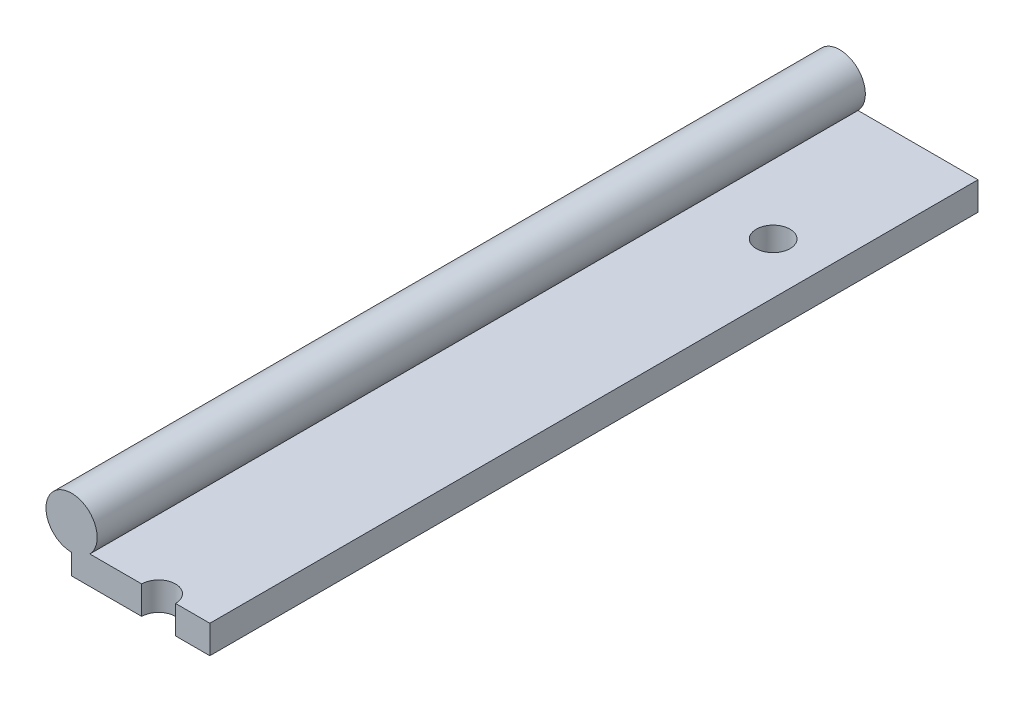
ISO-10303-21;
HEADER;
FILE_DESCRIPTION(('STEP AP214'),'2;1');
FILE_NAME('part.step','',(''),(''),'','','');
FILE_SCHEMA(('AUTOMOTIVE_DESIGN { 1 0 10303 214 1 1 1 1 }'));
ENDSEC;
DATA;
#1=APPLICATION_CONTEXT('core data for automotive mechanical design processes');
#2=APPLICATION_PROTOCOL_DEFINITION('international standard','automotive_design',2000,#1);
#3=PRODUCT_CONTEXT('',#1,'mechanical');
#4=PRODUCT('Part','Part','',(#3));
#5=PRODUCT_RELATED_PRODUCT_CATEGORY('part','',(#4));
#6=PRODUCT_DEFINITION_FORMATION('','',#4);
#7=PRODUCT_DEFINITION_CONTEXT('part definition',#1,'design');
#8=PRODUCT_DEFINITION('design','',#6,#7);
#9=PRODUCT_DEFINITION_SHAPE('','',#8);
#10=(LENGTH_UNIT() NAMED_UNIT(*) SI_UNIT(.MILLI.,.METRE.));
#11=(NAMED_UNIT(*) PLANE_ANGLE_UNIT() SI_UNIT($,.RADIAN.));
#12=(NAMED_UNIT(*) SI_UNIT($,.STERADIAN.) SOLID_ANGLE_UNIT());
#13=UNCERTAINTY_MEASURE_WITH_UNIT(LENGTH_MEASURE(1.E-05),#10,'distance_accuracy_value','');
#14=(GEOMETRIC_REPRESENTATION_CONTEXT(3) GLOBAL_UNCERTAINTY_ASSIGNED_CONTEXT((#13)) GLOBAL_UNIT_ASSIGNED_CONTEXT((#10,
#11,#12)) REPRESENTATION_CONTEXT('',''));
#15=CARTESIAN_POINT('',(0.,0.,0.));
#16=DIRECTION('',(0.,0.,1.));
#17=DIRECTION('',(1.,0.,0.));
#18=AXIS2_PLACEMENT_3D('',#15,#16,#17);
#19=CARTESIAN_POINT('',(-13.5,6.24999999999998,150.));
#20=DIRECTION('',(0.,0.,-1.));
#21=DIRECTION('',(-1.,0.,0.));
#22=AXIS2_PLACEMENT_3D('',#19,#20,#21);
#23=PLANE('',#22);
#24=DIRECTION('',(1.,0.,0.));
#25=VECTOR('',#24,1.);
#26=CARTESIAN_POINT('',(13.5,-2.75000000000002,150.));
#27=LINE('',#26,#25);
#28=CARTESIAN_POINT('',(-13.5,-2.75000000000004,150.));
#29=VERTEX_POINT('',#28);
#30=CARTESIAN_POINT('',(0.200000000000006,-2.75000000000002,150.));
#31=VERTEX_POINT('',#30);
#32=EDGE_CURVE('E121',#29,#31,#27,.T.);
#33=ORIENTED_EDGE('',*,*,#32,.T.);
#34=DIRECTION('',(0.,1.,0.));
#35=VECTOR('',#34,1.);
#36=CARTESIAN_POINT('',(0.199999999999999,2.74999999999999,150.));
#37=LINE('',#36,#35);
#38=CARTESIAN_POINT('',(0.199999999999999,2.74999999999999,150.));
#39=VERTEX_POINT('',#38);
#40=EDGE_CURVE('E11',#31,#39,#37,.T.);
#41=ORIENTED_EDGE('',*,*,#40,.T.);
#42=DIRECTION('',(-1.,0.,0.));
#43=VECTOR('',#42,1.);
#44=CARTESIAN_POINT('',(13.5,2.74999999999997,150.));
#45=LINE('',#44,#43);
#46=CARTESIAN_POINT('',(-9.92928578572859,2.74999999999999,150.));
#47=VERTEX_POINT('',#46);
#48=EDGE_CURVE('E103',#39,#47,#45,.T.);
#49=ORIENTED_EDGE('',*,*,#48,.T.);
#50=CARTESIAN_POINT('',(-13.5,6.24999999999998,150.));
#51=DIRECTION('',(0.,0.,1.));
#52=DIRECTION('',(-1.,0.,0.));
#53=AXIS2_PLACEMENT_3D('',#50,#51,#52);
#54=CIRCLE('',#53,5.);
#55=CARTESIAN_POINT('',(-13.5,1.24999999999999,150.));
#56=VERTEX_POINT('',#55);
#57=EDGE_CURVE('E96',#47,#56,#54,.T.);
#58=ORIENTED_EDGE('',*,*,#57,.T.);
#59=DIRECTION('',(0.,-1.,0.));
#60=VECTOR('',#59,1.);
#61=CARTESIAN_POINT('',(-13.5,1.24999999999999,150.));
#62=LINE('',#61,#60);
#63=EDGE_CURVE('E100',#56,#29,#62,.T.);
#64=ORIENTED_EDGE('',*,*,#63,.T.);
#65=EDGE_LOOP('',(#33,#41,#49,#58,#64));
#66=FACE_BOUND('',#65,.T.);
#67=ADVANCED_FACE('F30',(#66),#23,.F.);
#68=CARTESIAN_POINT('',(13.5,2.74999999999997,150.));
#69=DIRECTION('',(-1.,0.,0.));
#70=DIRECTION('',(0.,0.,1.));
#71=AXIS2_PLACEMENT_3D('',#68,#69,#70);
#72=PLANE('',#71);
#73=DIRECTION('',(0.,1.,0.));
#74=VECTOR('',#73,1.);
#75=CARTESIAN_POINT('',(13.5,2.74999999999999,0.));
#76=LINE('',#75,#74);
#77=CARTESIAN_POINT('',(13.5,-2.75,0.));
#78=VERTEX_POINT('',#77);
#79=CARTESIAN_POINT('',(13.5,2.74999999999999,0.));
#80=VERTEX_POINT('',#79);
#81=EDGE_CURVE('E126',#78,#80,#76,.T.);
#82=ORIENTED_EDGE('',*,*,#81,.T.);
#83=DIRECTION('',(0.,0.,-1.));
#84=VECTOR('',#83,1.);
#85=CARTESIAN_POINT('',(13.5,2.74999999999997,150.));
#86=LINE('',#85,#84);
#87=CARTESIAN_POINT('',(13.5,2.74999999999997,150.));
#88=VERTEX_POINT('',#87);
#89=EDGE_CURVE('E139',#88,#80,#86,.T.);
#90=ORIENTED_EDGE('',*,*,#89,.F.);
#91=DIRECTION('',(0.,1.,0.));
#92=VECTOR('',#91,1.);
#93=CARTESIAN_POINT('',(13.5,2.74999999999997,150.));
#94=LINE('',#93,#92);
#95=CARTESIAN_POINT('',(13.5,-2.75000000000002,150.));
#96=VERTEX_POINT('',#95);
#97=EDGE_CURVE('E135',#96,#88,#94,.T.);
#98=ORIENTED_EDGE('',*,*,#97,.F.);
#99=DIRECTION('',(0.,0.,-1.));
#100=VECTOR('',#99,1.);
#101=CARTESIAN_POINT('',(13.5,-2.75000000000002,150.));
#102=LINE('',#101,#100);
#103=EDGE_CURVE('E125',#96,#78,#102,.T.);
#104=ORIENTED_EDGE('',*,*,#103,.T.);
#105=EDGE_LOOP('',(#82,#90,#98,#104));
#106=FACE_BOUND('',#105,.T.);
#107=ADVANCED_FACE('F32',(#106),#72,.F.);
#108=CARTESIAN_POINT('',(13.5,2.74999999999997,150.));
#109=DIRECTION('',(0.,-1.,0.));
#110=DIRECTION('',(1.,0.,0.));
#111=AXIS2_PLACEMENT_3D('',#108,#109,#110);
#112=PLANE('',#111);
#113=CARTESIAN_POINT('',(3.5,2.74999999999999,30.));
#114=DIRECTION('',(0.,1.,0.));
#115=DIRECTION('',(0.,0.,1.));
#116=AXIS2_PLACEMENT_3D('',#113,#114,#115);
#117=CIRCLE('',#116,3.3);
#118=CARTESIAN_POINT('',(3.5,2.74999999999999,33.3));
#119=VERTEX_POINT('',#118);
#120=EDGE_CURVE('E154',#119,#119,#117,.T.);
#121=ORIENTED_EDGE('',*,*,#120,.F.);
#122=EDGE_LOOP('',(#121));
#123=FACE_BOUND('',#122,.T.);
#124=ORIENTED_EDGE('',*,*,#48,.F.);
#125=CARTESIAN_POINT('',(3.5,2.74999999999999,150.));
#126=DIRECTION('',(0.,1.,0.));
#127=DIRECTION('',(0.,0.,1.));
#128=AXIS2_PLACEMENT_3D('',#125,#126,#127);
#129=CIRCLE('',#128,3.3);
#130=CARTESIAN_POINT('',(6.79999999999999,2.75,150.));
#131=VERTEX_POINT('',#130);
#132=EDGE_CURVE('E152',#131,#39,#129,.T.);
#133=ORIENTED_EDGE('',*,*,#132,.F.);
#134=EDGE_CURVE('E88',#88,#131,#45,.T.);
#135=ORIENTED_EDGE('',*,*,#134,.F.);
#136=ORIENTED_EDGE('',*,*,#89,.T.);
#137=DIRECTION('',(-1.,0.,0.));
#138=VECTOR('',#137,1.);
#139=CARTESIAN_POINT('',(13.5,2.74999999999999,0.));
#140=LINE('',#139,#138);
#141=CARTESIAN_POINT('',(-9.92928578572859,2.74999999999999,0.));
#142=VERTEX_POINT('',#141);
#143=EDGE_CURVE('E129',#80,#142,#140,.T.);
#144=ORIENTED_EDGE('',*,*,#143,.T.);
#145=DIRECTION('',(0.,0.,-1.));
#146=VECTOR('',#145,1.);
#147=CARTESIAN_POINT('',(-9.92928578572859,2.74999999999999,150.));
#148=LINE('',#147,#146);
#149=EDGE_CURVE('E115',#47,#142,#148,.T.);
#150=ORIENTED_EDGE('',*,*,#149,.F.);
#151=EDGE_LOOP('',(#124,#133,#135,#136,#144,#150));
#152=FACE_BOUND('',#151,.T.);
#153=ADVANCED_FACE('F176',(#123,#152),#112,.F.);
#154=CARTESIAN_POINT('',(-13.5,6.24999999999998,150.));
#155=DIRECTION('',(0.,0.,-1.));
#156=DIRECTION('',(-1.,0.,0.));
#157=AXIS2_PLACEMENT_3D('',#154,#155,#156);
#158=CYLINDRICAL_SURFACE('',#157,5.);
#159=CARTESIAN_POINT('',(-13.5,6.24999999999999,0.));
#160=DIRECTION('',(0.,0.,1.));
#161=DIRECTION('',(-1.,0.,0.));
#162=AXIS2_PLACEMENT_3D('',#159,#160,#161);
#163=CIRCLE('',#162,5.);
#164=CARTESIAN_POINT('',(-13.5,1.24999999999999,0.));
#165=VERTEX_POINT('',#164);
#166=EDGE_CURVE('E112',#142,#165,#163,.T.);
#167=ORIENTED_EDGE('',*,*,#166,.T.);
#168=DIRECTION('',(0.,0.,-1.));
#169=VECTOR('',#168,1.);
#170=CARTESIAN_POINT('',(-13.5,1.24999999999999,150.));
#171=LINE('',#170,#169);
#172=EDGE_CURVE('E109',#56,#165,#171,.T.);
#173=ORIENTED_EDGE('',*,*,#172,.F.);
#174=ORIENTED_EDGE('',*,*,#57,.F.);
#175=ORIENTED_EDGE('',*,*,#149,.T.);
#176=EDGE_LOOP('',(#167,#173,#174,#175));
#177=FACE_BOUND('',#176,.T.);
#178=ADVANCED_FACE('F110',(#177),#158,.T.);
#179=CARTESIAN_POINT('',(-13.5,1.24999999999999,150.));
#180=DIRECTION('',(1.,0.,0.));
#181=DIRECTION('',(0.,0.,-1.));
#182=AXIS2_PLACEMENT_3D('',#179,#180,#181);
#183=PLANE('',#182);
#184=DIRECTION('',(0.,-1.,0.));
#185=VECTOR('',#184,1.);
#186=CARTESIAN_POINT('',(-13.5,1.24999999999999,0.));
#187=LINE('',#186,#185);
#188=CARTESIAN_POINT('',(-13.5,-2.75000000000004,0.));
#189=VERTEX_POINT('',#188);
#190=EDGE_CURVE('E132',#165,#189,#187,.T.);
#191=ORIENTED_EDGE('',*,*,#190,.T.);
#192=DIRECTION('',(0.,0.,-1.));
#193=VECTOR('',#192,1.);
#194=CARTESIAN_POINT('',(-13.5,-2.75000000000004,150.));
#195=LINE('',#194,#193);
#196=EDGE_CURVE('E116',#29,#189,#195,.T.);
#197=ORIENTED_EDGE('',*,*,#196,.F.);
#198=ORIENTED_EDGE('',*,*,#63,.F.);
#199=ORIENTED_EDGE('',*,*,#172,.T.);
#200=EDGE_LOOP('',(#191,#197,#198,#199));
#201=FACE_BOUND('',#200,.T.);
#202=ADVANCED_FACE('F118',(#201),#183,.F.);
#203=CARTESIAN_POINT('',(13.5,-2.75000000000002,150.));
#204=DIRECTION('',(0.,1.,0.));
#205=DIRECTION('',(-1.,0.,0.));
#206=AXIS2_PLACEMENT_3D('',#203,#204,#205);
#207=PLANE('',#206);
#208=CARTESIAN_POINT('',(3.5,-2.75000000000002,30.));
#209=DIRECTION('',(0.,1.,0.));
#210=DIRECTION('',(-1.,0.,0.));
#211=AXIS2_PLACEMENT_3D('',#208,#209,#210);
#212=CIRCLE('',#211,3.3);
#213=CARTESIAN_POINT('',(0.199999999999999,-2.75000000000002,30.));
#214=VERTEX_POINT('',#213);
#215=EDGE_CURVE('E34',#214,#214,#212,.T.);
#216=ORIENTED_EDGE('',*,*,#215,.T.);
#217=EDGE_LOOP('',(#216));
#218=FACE_BOUND('',#217,.T.);
#219=CARTESIAN_POINT('',(6.8,-2.75,150.));
#220=VERTEX_POINT('',#219);
#221=EDGE_CURVE('E54',#220,#96,#27,.T.);
#222=ORIENTED_EDGE('',*,*,#221,.F.);
#223=CARTESIAN_POINT('',(3.5,-2.75000000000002,150.));
#224=DIRECTION('',(0.,1.,0.));
#225=DIRECTION('',(-1.,0.,0.));
#226=AXIS2_PLACEMENT_3D('',#223,#224,#225);
#227=CIRCLE('',#226,3.3);
#228=EDGE_CURVE('E46',#220,#31,#227,.T.);
#229=ORIENTED_EDGE('',*,*,#228,.T.);
#230=ORIENTED_EDGE('',*,*,#32,.F.);
#231=ORIENTED_EDGE('',*,*,#196,.T.);
#232=DIRECTION('',(1.,0.,0.));
#233=VECTOR('',#232,1.);
#234=CARTESIAN_POINT('',(13.5,-2.75,0.));
#235=LINE('',#234,#233);
#236=EDGE_CURVE('E79',#189,#78,#235,.T.);
#237=ORIENTED_EDGE('',*,*,#236,.T.);
#238=ORIENTED_EDGE('',*,*,#103,.F.);
#239=EDGE_LOOP('',(#222,#229,#230,#231,#237,#238));
#240=FACE_BOUND('',#239,.T.);
#241=ADVANCED_FACE('F144',(#218,#240),#207,.F.);
#242=ORIENTED_EDGE('',*,*,#134,.T.);
#243=DIRECTION('',(0.,1.,0.));
#244=VECTOR('',#243,1.);
#245=CARTESIAN_POINT('',(6.79999999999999,2.75,150.));
#246=LINE('',#245,#244);
#247=EDGE_CURVE('E39',#131,#220,#246,.F.);
#248=ORIENTED_EDGE('',*,*,#247,.T.);
#249=ORIENTED_EDGE('',*,*,#221,.T.);
#250=ORIENTED_EDGE('',*,*,#97,.T.);
#251=EDGE_LOOP('',(#242,#248,#249,#250));
#252=FACE_BOUND('',#251,.T.);
#253=ADVANCED_FACE('F141',(#252),#23,.F.);
#254=CARTESIAN_POINT('',(-13.5,6.24999999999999,0.));
#255=DIRECTION('',(0.,0.,-1.));
#256=DIRECTION('',(-1.,0.,0.));
#257=AXIS2_PLACEMENT_3D('',#254,#255,#256);
#258=PLANE('',#257);
#259=ORIENTED_EDGE('',*,*,#81,.F.);
#260=ORIENTED_EDGE('',*,*,#236,.F.);
#261=ORIENTED_EDGE('',*,*,#190,.F.);
#262=ORIENTED_EDGE('',*,*,#166,.F.);
#263=ORIENTED_EDGE('',*,*,#143,.F.);
#264=EDGE_LOOP('',(#259,#260,#261,#262,#263));
#265=FACE_BOUND('',#264,.T.);
#266=ADVANCED_FACE('F169',(#265),#258,.T.);
#267=CARTESIAN_POINT('',(3.5,2.74999999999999,150.));
#268=DIRECTION('',(0.,1.,0.));
#269=DIRECTION('',(0.,0.,1.));
#270=AXIS2_PLACEMENT_3D('',#267,#268,#269);
#271=CYLINDRICAL_SURFACE('',#270,3.3);
#272=ORIENTED_EDGE('',*,*,#228,.F.);
#273=ORIENTED_EDGE('',*,*,#247,.F.);
#274=ORIENTED_EDGE('',*,*,#132,.T.);
#275=ORIENTED_EDGE('',*,*,#40,.F.);
#276=EDGE_LOOP('',(#272,#273,#274,#275));
#277=FACE_BOUND('',#276,.T.);
#278=ADVANCED_FACE('F164',(#277),#271,.F.);
#279=CARTESIAN_POINT('',(3.5,2.74999999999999,30.));
#280=DIRECTION('',(0.,1.,0.));
#281=DIRECTION('',(0.,0.,1.));
#282=AXIS2_PLACEMENT_3D('',#279,#280,#281);
#283=CYLINDRICAL_SURFACE('',#282,3.3);
#284=ORIENTED_EDGE('',*,*,#120,.T.);
#285=EDGE_LOOP('',(#284));
#286=FACE_BOUND('',#285,.T.);
#287=ORIENTED_EDGE('',*,*,#215,.F.);
#288=EDGE_LOOP('',(#287));
#289=FACE_BOUND('',#288,.T.);
#290=ADVANCED_FACE('F162',(#286,#289),#283,.F.);
#291=CLOSED_SHELL('',(#67,#107,#153,#178,#202,#241,#253,#266,#278,#290));
#292=MANIFOLD_SOLID_BREP('B2',#291);
#293=ADVANCED_BREP_SHAPE_REPRESENTATION('',(#18,#292),#14);
#294=SHAPE_DEFINITION_REPRESENTATION(#9,#293);
ENDSEC;
END-ISO-10303-21;
